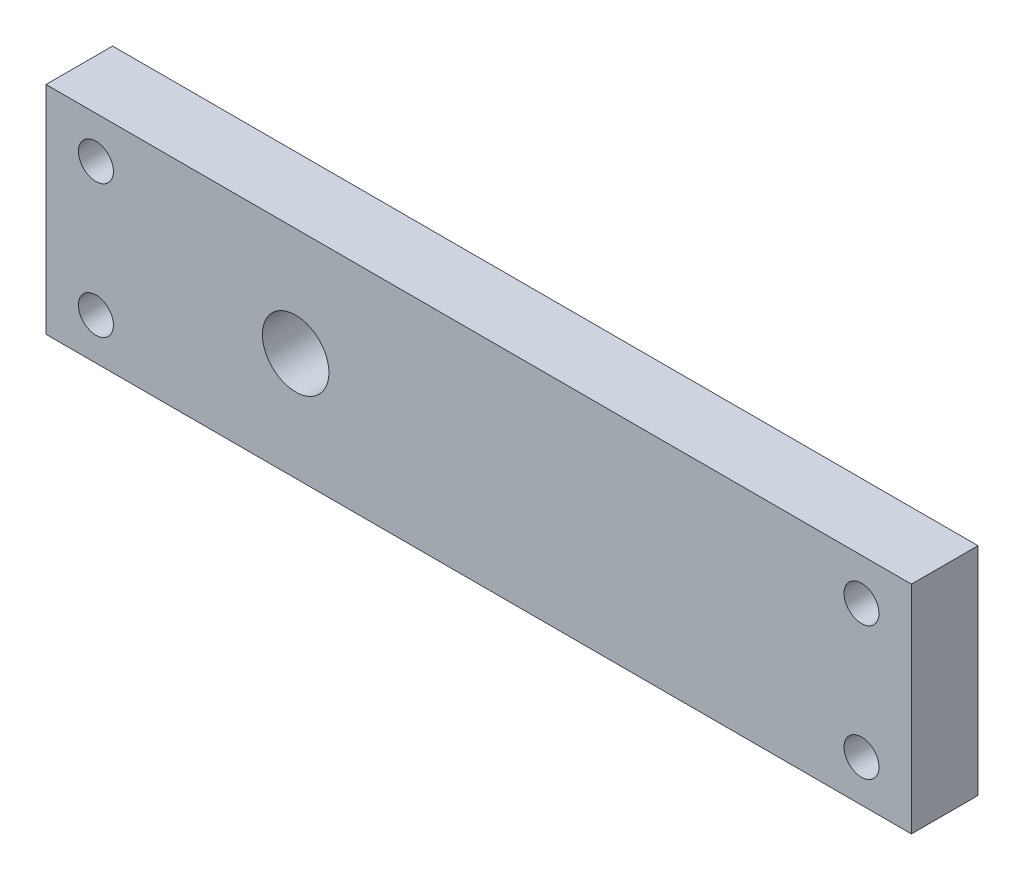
from build123d import *

# Parameters (mm, degrees)
ESQUISSE1_W             = 104
ESQUISSE1_H             = 26
EXTRUSION1_DEPTH        = 8
ESQUISSE2_R             = 4
ENL_V_MAT_EXTRU_1_DEPTH = 108.498837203
TROU_TARAUD_M51_D       = 4.2


with BuildPart() as part:
    # Esquisse1 → Extrusion1 (new body)
    with BuildSketch(Plane.XY):
        with Locations((52, 13)):
            Rectangle(ESQUISSE1_W, ESQUISSE1_H)
    extrude(amount=EXTRUSION1_DEPTH)

    # Esquisse2 → Enl_v. mat.-Extru.1 (cut, through all)
    with BuildSketch(Plane.XY.offset(8)):
        with Locations((30, 13)):
            Circle(ESQUISSE2_R)
    extrude(amount=-ENL_V_MAT_EXTRU_1_DEPTH, mode=Mode.SUBTRACT)

    # Trou taraud_ M51 (through all)
    with Locations(Plane.XY.offset(8)):
        with Locations((6, 21), (6, 5), (98, 21), (98, 5)):
            Hole(TROU_TARAUD_M51_D / 2)


solid = part.part
